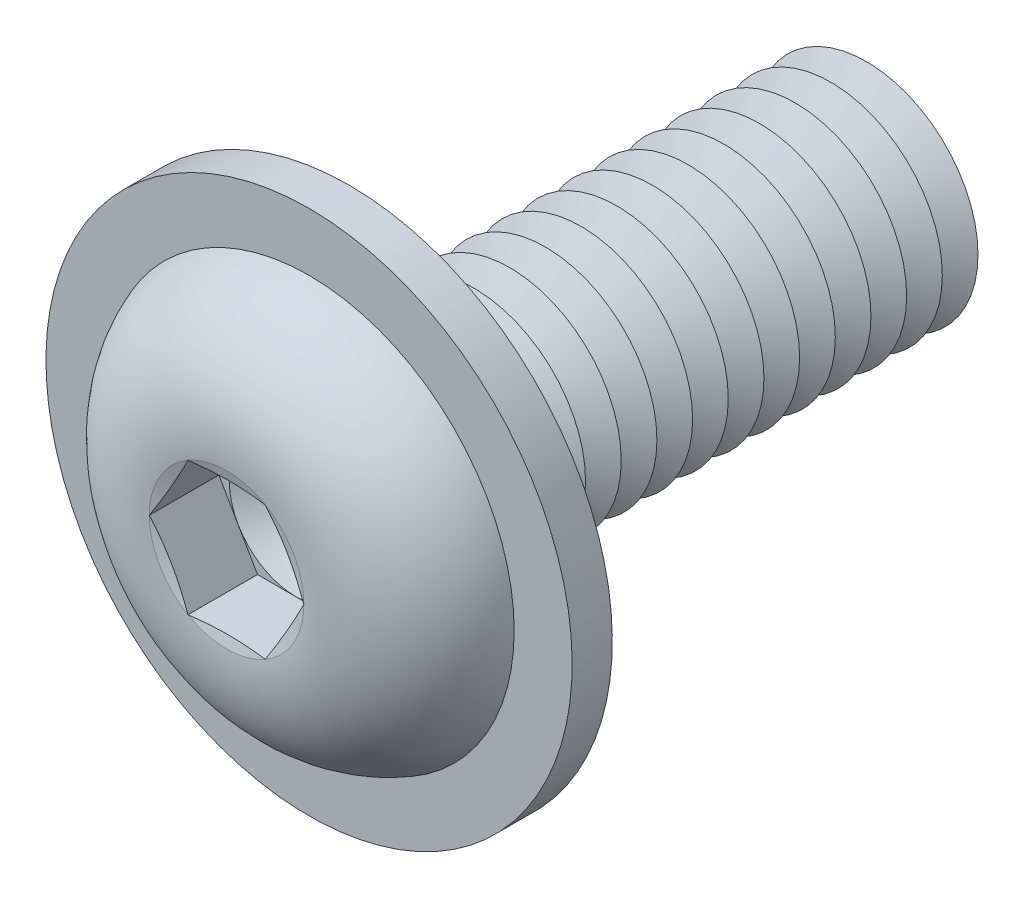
from build123d import *

# Parameters (mm, degrees)
FILLET1_R           = 0.4
LPATTERN1_COUNT     = 15
LPATTERN1_PITCH     = 0.8
CUT_EXTRUDE1_DEPTH  = 1.56
SKETCH5_R           = 5.9
SKETCH5_R_2         = 2.9
BOSS_EXTRUDE1_DEPTH = 0.9


with BuildPart() as part:
    # Sketch1 → Revolve1 (revolve)
    with BuildSketch(Plane(origin=(0, 0, 0), x_dir=(0, 0, -1), z_dir=(1, 0, 0)), mode=Mode.PRIVATE) as revolve1_sk:
        with BuildLine():
            Line((0, 2.5), (0, 4.75))
            ThreePointArc((0, 4.75), (-2.041477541, 3.848329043), (-2.75, 1.73205))
            Line((-2.75, 1.73205), (-2.517949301, 0.866025))
            Line((-2.517949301, 0.866025), (-2.75, 0.866025))
            Line((-2.75, 0.866025), (-2.75, 0))
            Line((-2.75, 0), (12, 0))
            Line((12, 0), (12, 2.5))
            Line((12, 2.5), (0, 2.5))
        make_face()
    revolve(revolve1_sk.sketch.rotate(Axis((0, 0, -12), (0, 0, 1)), 90), axis=Axis((0, 0, -12), (0, 0, 1)))

    # Fillet1
    fillet1_edges = [part.edges().sort_by_distance(p)[0] for p in [
        (2.5, 0, 0),
    ]]
    fillet(fillet1_edges, radius=FILLET1_R)

    # Sketch2 → Cut-Revolve1 (revolve, cut)
    with BuildSketch(Plane(origin=(0, 0, 0), x_dir=(0, 0, -1), z_dir=(1, 0, 0)), mode=Mode.PRIVATE) as cut_revolve1_sk:
        Polygon((11.6, 2.5), (12.4, 2.5), (12, 1.807179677), align=None)
    cut_revolve1 = revolve(cut_revolve1_sk.sketch.rotate(Axis((0, 0, -12), (0, 0, -1)), 270), axis=Axis((0, 0, -12), (0, 0, -1)), mode=Mode.SUBTRACT)

    # LPattern1: Cut-Revolve1 ×15
    with Locations(*[(0, 0, i * LPATTERN1_PITCH) for i in range(1, LPATTERN1_COUNT)]):
        add(cut_revolve1, mode=Mode.SUBTRACT)

    # Sketch3 → Cut-Extrude1 (cut)
    with BuildSketch(Plane.XY.offset(2.75)):
        Polygon((0.866025, 1.499999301), (-0.866025, 1.499999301), (-1.73205, 0), (-0.866025, -1.499999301), (0.866025, -1.499999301), (1.73205, 0), align=None)
    extrude(amount=-CUT_EXTRUDE1_DEPTH, mode=Mode.SUBTRACT)

    # Cut-Extrude2 cone 1 section (on through the dimple's axis) → Cut-Extrude2 (revolve, cut)
    with BuildSketch(Plane(origin=(0, 0, 1.19), x_dir=(0, -1, 0), z_dir=(1, 0, 0))):
        Polygon((0, 0), (1.499999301, 0), (0, 0.866025), align=None)
    revolve(axis=Axis((0, 0, 1.19), (0, 0, -1)), mode=Mode.SUBTRACT)

    # Sketch5 → Boss-Extrude1 (add)
    with BuildSketch(Plane(origin=(0, 0, 0), x_dir=(-1, 0, 0), z_dir=(0, 0, -1))):
        with Locations(Location((0, 0, 0), (0, 0, 90))):
            Circle(SKETCH5_R)
        Circle(SKETCH5_R_2, mode=Mode.SUBTRACT)
    extrude(amount=-BOSS_EXTRUDE1_DEPTH)


solid = part.part
